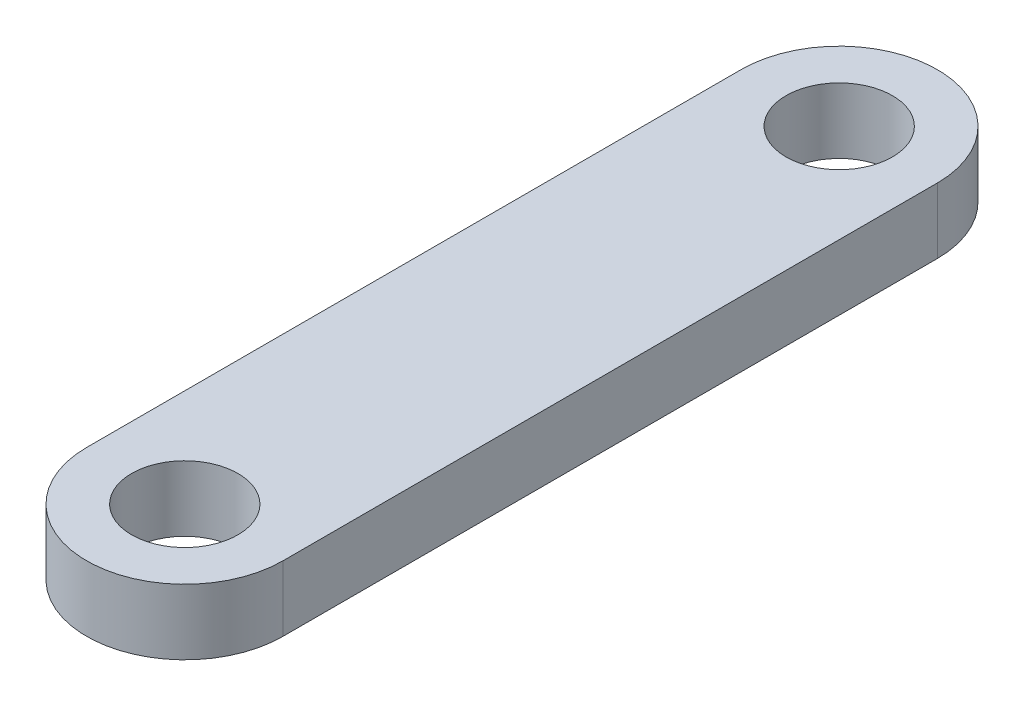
ISO-10303-21;
HEADER;
FILE_DESCRIPTION(('STEP AP214'),'2;1');
FILE_NAME('part.step','',(''),(''),'','','');
FILE_SCHEMA(('AUTOMOTIVE_DESIGN { 1 0 10303 214 1 1 1 1 }'));
ENDSEC;
DATA;
#1=APPLICATION_CONTEXT('core data for automotive mechanical design processes');
#2=APPLICATION_PROTOCOL_DEFINITION('international standard','automotive_design',2000,#1);
#3=PRODUCT_CONTEXT('',#1,'mechanical');
#4=PRODUCT('Part','Part','',(#3));
#5=PRODUCT_RELATED_PRODUCT_CATEGORY('part','',(#4));
#6=PRODUCT_DEFINITION_FORMATION('','',#4);
#7=PRODUCT_DEFINITION_CONTEXT('part definition',#1,'design');
#8=PRODUCT_DEFINITION('design','',#6,#7);
#9=PRODUCT_DEFINITION_SHAPE('','',#8);
#10=(LENGTH_UNIT() NAMED_UNIT(*) SI_UNIT(.MILLI.,.METRE.));
#11=(NAMED_UNIT(*) PLANE_ANGLE_UNIT() SI_UNIT($,.RADIAN.));
#12=(NAMED_UNIT(*) SI_UNIT($,.STERADIAN.) SOLID_ANGLE_UNIT());
#13=UNCERTAINTY_MEASURE_WITH_UNIT(LENGTH_MEASURE(1.E-05),#10,'distance_accuracy_value','');
#14=(GEOMETRIC_REPRESENTATION_CONTEXT(3) GLOBAL_UNCERTAINTY_ASSIGNED_CONTEXT((#13)) GLOBAL_UNIT_ASSIGNED_CONTEXT((#10,
#11,#12)) REPRESENTATION_CONTEXT('',''));
#15=CARTESIAN_POINT('',(0.,0.,0.));
#16=DIRECTION('',(0.,0.,1.));
#17=DIRECTION('',(1.,0.,0.));
#18=AXIS2_PLACEMENT_3D('',#15,#16,#17);
#19=CARTESIAN_POINT('',(0.,4.,-40.));
#20=DIRECTION('',(0.,1.,0.));
#21=DIRECTION('',(0.,0.,1.));
#22=AXIS2_PLACEMENT_3D('',#19,#20,#21);
#23=PLANE('',#22);
#24=CARTESIAN_POINT('',(0.,4.,-40.));
#25=DIRECTION('',(0.,1.,0.));
#26=DIRECTION('',(0.,0.,1.));
#27=AXIS2_PLACEMENT_3D('',#24,#25,#26);
#28=CIRCLE('',#27,3.25);
#29=CARTESIAN_POINT('',(0.,4.,-36.75));
#30=VERTEX_POINT('',#29);
#31=EDGE_CURVE('E98',#30,#30,#28,.T.);
#32=ORIENTED_EDGE('',*,*,#31,.F.);
#33=EDGE_LOOP('',(#32));
#34=FACE_BOUND('',#33,.T.);
#35=CARTESIAN_POINT('',(0.,4.,-40.));
#36=DIRECTION('',(0.,1.,0.));
#37=DIRECTION('',(0.,0.,1.));
#38=AXIS2_PLACEMENT_3D('',#35,#36,#37);
#39=CIRCLE('',#38,6.);
#40=CARTESIAN_POINT('',(6.,4.,-40.));
#41=VERTEX_POINT('',#40);
#42=CARTESIAN_POINT('',(-6.,4.,-40.));
#43=VERTEX_POINT('',#42);
#44=EDGE_CURVE('E83',#41,#43,#39,.T.);
#45=ORIENTED_EDGE('',*,*,#44,.T.);
#46=DIRECTION('',(0.,0.,1.));
#47=VECTOR('',#46,1.);
#48=CARTESIAN_POINT('',(-6.,4.,-40.));
#49=LINE('',#48,#47);
#50=CARTESIAN_POINT('',(-6.,4.,0.));
#51=VERTEX_POINT('',#50);
#52=EDGE_CURVE('E78',#43,#51,#49,.T.);
#53=ORIENTED_EDGE('',*,*,#52,.T.);
#54=CARTESIAN_POINT('',(0.,4.,0.));
#55=DIRECTION('',(0.,1.,0.));
#56=DIRECTION('',(0.,0.,1.));
#57=AXIS2_PLACEMENT_3D('',#54,#55,#56);
#58=CIRCLE('',#57,6.);
#59=CARTESIAN_POINT('',(6.,4.,0.));
#60=VERTEX_POINT('',#59);
#61=EDGE_CURVE('E81',#51,#60,#58,.T.);
#62=ORIENTED_EDGE('',*,*,#61,.T.);
#63=DIRECTION('',(0.,0.,-1.));
#64=VECTOR('',#63,1.);
#65=CARTESIAN_POINT('',(6.,4.,-40.));
#66=LINE('',#65,#64);
#67=EDGE_CURVE('E48',#60,#41,#66,.T.);
#68=ORIENTED_EDGE('',*,*,#67,.T.);
#69=EDGE_LOOP('',(#45,#53,#62,#68));
#70=FACE_BOUND('',#69,.T.);
#71=CARTESIAN_POINT('',(0.,4.,0.));
#72=DIRECTION('',(0.,1.,0.));
#73=DIRECTION('',(0.,0.,1.));
#74=AXIS2_PLACEMENT_3D('',#71,#72,#73);
#75=CIRCLE('',#74,3.25);
#76=CARTESIAN_POINT('',(0.,4.,3.25));
#77=VERTEX_POINT('',#76);
#78=EDGE_CURVE('E113',#77,#77,#75,.T.);
#79=ORIENTED_EDGE('',*,*,#78,.F.);
#80=EDGE_LOOP('',(#79));
#81=FACE_BOUND('',#80,.T.);
#82=ADVANCED_FACE('F31',(#34,#70,#81),#23,.T.);
#83=CARTESIAN_POINT('',(0.,0.,-40.));
#84=DIRECTION('',(0.,1.,0.));
#85=DIRECTION('',(0.,0.,1.));
#86=AXIS2_PLACEMENT_3D('',#83,#84,#85);
#87=PLANE('',#86);
#88=CARTESIAN_POINT('',(0.,0.,-40.));
#89=DIRECTION('',(0.,1.,0.));
#90=DIRECTION('',(0.,0.,1.));
#91=AXIS2_PLACEMENT_3D('',#88,#89,#90);
#92=CIRCLE('',#91,3.25);
#93=CARTESIAN_POINT('',(0.,0.,-36.75));
#94=VERTEX_POINT('',#93);
#95=EDGE_CURVE('E110',#94,#94,#92,.T.);
#96=ORIENTED_EDGE('',*,*,#95,.T.);
#97=EDGE_LOOP('',(#96));
#98=FACE_BOUND('',#97,.T.);
#99=CARTESIAN_POINT('',(0.,0.,-40.));
#100=DIRECTION('',(0.,1.,0.));
#101=DIRECTION('',(0.,0.,1.));
#102=AXIS2_PLACEMENT_3D('',#99,#100,#101);
#103=CIRCLE('',#102,6.);
#104=CARTESIAN_POINT('',(6.,0.,-40.));
#105=VERTEX_POINT('',#104);
#106=CARTESIAN_POINT('',(-6.,0.,-40.));
#107=VERTEX_POINT('',#106);
#108=EDGE_CURVE('E95',#105,#107,#103,.T.);
#109=ORIENTED_EDGE('',*,*,#108,.F.);
#110=DIRECTION('',(0.,0.,-1.));
#111=VECTOR('',#110,1.);
#112=CARTESIAN_POINT('',(6.,0.,-40.));
#113=LINE('',#112,#111);
#114=CARTESIAN_POINT('',(6.,0.,0.));
#115=VERTEX_POINT('',#114);
#116=EDGE_CURVE('E71',#115,#105,#113,.T.);
#117=ORIENTED_EDGE('',*,*,#116,.F.);
#118=CARTESIAN_POINT('',(0.,0.,0.));
#119=DIRECTION('',(0.,1.,0.));
#120=DIRECTION('',(0.,0.,1.));
#121=AXIS2_PLACEMENT_3D('',#118,#119,#120);
#122=CIRCLE('',#121,6.);
#123=CARTESIAN_POINT('',(-6.,0.,0.));
#124=VERTEX_POINT('',#123);
#125=EDGE_CURVE('E65',#124,#115,#122,.T.);
#126=ORIENTED_EDGE('',*,*,#125,.F.);
#127=DIRECTION('',(0.,0.,1.));
#128=VECTOR('',#127,1.);
#129=CARTESIAN_POINT('',(-6.,0.,-40.));
#130=LINE('',#129,#128);
#131=EDGE_CURVE('E87',#107,#124,#130,.T.);
#132=ORIENTED_EDGE('',*,*,#131,.F.);
#133=EDGE_LOOP('',(#109,#117,#126,#132));
#134=FACE_BOUND('',#133,.T.);
#135=CARTESIAN_POINT('',(0.,0.,0.));
#136=DIRECTION('',(0.,1.,0.));
#137=DIRECTION('',(0.,0.,1.));
#138=AXIS2_PLACEMENT_3D('',#135,#136,#137);
#139=CIRCLE('',#138,3.25);
#140=CARTESIAN_POINT('',(0.,0.,3.25));
#141=VERTEX_POINT('',#140);
#142=EDGE_CURVE('E116',#141,#141,#139,.T.);
#143=ORIENTED_EDGE('',*,*,#142,.T.);
#144=EDGE_LOOP('',(#143));
#145=FACE_BOUND('',#144,.T.);
#146=ADVANCED_FACE('F106',(#98,#134,#145),#87,.F.);
#147=CARTESIAN_POINT('',(0.,4.,-40.));
#148=DIRECTION('',(0.,-1.,0.));
#149=DIRECTION('',(0.,0.,-1.));
#150=AXIS2_PLACEMENT_3D('',#147,#148,#149);
#151=CYLINDRICAL_SURFACE('',#150,6.);
#152=ORIENTED_EDGE('',*,*,#108,.T.);
#153=DIRECTION('',(0.,-1.,0.));
#154=VECTOR('',#153,1.);
#155=CARTESIAN_POINT('',(-6.,4.,-40.));
#156=LINE('',#155,#154);
#157=EDGE_CURVE('E11',#43,#107,#156,.T.);
#158=ORIENTED_EDGE('',*,*,#157,.F.);
#159=ORIENTED_EDGE('',*,*,#44,.F.);
#160=DIRECTION('',(0.,-1.,0.));
#161=VECTOR('',#160,1.);
#162=CARTESIAN_POINT('',(6.,4.,-40.));
#163=LINE('',#162,#161);
#164=EDGE_CURVE('E91',#41,#105,#163,.T.);
#165=ORIENTED_EDGE('',*,*,#164,.T.);
#166=EDGE_LOOP('',(#152,#158,#159,#165));
#167=FACE_BOUND('',#166,.T.);
#168=ADVANCED_FACE('F33',(#167),#151,.T.);
#169=CARTESIAN_POINT('',(-6.,4.,-40.));
#170=DIRECTION('',(1.,0.,0.));
#171=DIRECTION('',(0.,0.,-1.));
#172=AXIS2_PLACEMENT_3D('',#169,#170,#171);
#173=PLANE('',#172);
#174=ORIENTED_EDGE('',*,*,#131,.T.);
#175=DIRECTION('',(0.,-1.,0.));
#176=VECTOR('',#175,1.);
#177=CARTESIAN_POINT('',(-6.,4.,0.));
#178=LINE('',#177,#176);
#179=EDGE_CURVE('E40',#51,#124,#178,.T.);
#180=ORIENTED_EDGE('',*,*,#179,.F.);
#181=ORIENTED_EDGE('',*,*,#52,.F.);
#182=ORIENTED_EDGE('',*,*,#157,.T.);
#183=EDGE_LOOP('',(#174,#180,#181,#182));
#184=FACE_BOUND('',#183,.T.);
#185=ADVANCED_FACE('F86',(#184),#173,.F.);
#186=CARTESIAN_POINT('',(0.,4.,0.));
#187=DIRECTION('',(0.,-1.,0.));
#188=DIRECTION('',(0.,0.,-1.));
#189=AXIS2_PLACEMENT_3D('',#186,#187,#188);
#190=CYLINDRICAL_SURFACE('',#189,6.);
#191=ORIENTED_EDGE('',*,*,#125,.T.);
#192=DIRECTION('',(0.,-1.,0.));
#193=VECTOR('',#192,1.);
#194=CARTESIAN_POINT('',(6.,4.,0.));
#195=LINE('',#194,#193);
#196=EDGE_CURVE('E88',#60,#115,#195,.T.);
#197=ORIENTED_EDGE('',*,*,#196,.F.);
#198=ORIENTED_EDGE('',*,*,#61,.F.);
#199=ORIENTED_EDGE('',*,*,#179,.T.);
#200=EDGE_LOOP('',(#191,#197,#198,#199));
#201=FACE_BOUND('',#200,.T.);
#202=ADVANCED_FACE('F89',(#201),#190,.T.);
#203=CARTESIAN_POINT('',(6.,4.,-40.));
#204=DIRECTION('',(-1.,0.,0.));
#205=DIRECTION('',(0.,0.,1.));
#206=AXIS2_PLACEMENT_3D('',#203,#204,#205);
#207=PLANE('',#206);
#208=ORIENTED_EDGE('',*,*,#116,.T.);
#209=ORIENTED_EDGE('',*,*,#164,.F.);
#210=ORIENTED_EDGE('',*,*,#67,.F.);
#211=ORIENTED_EDGE('',*,*,#196,.T.);
#212=EDGE_LOOP('',(#208,#209,#210,#211));
#213=FACE_BOUND('',#212,.T.);
#214=ADVANCED_FACE('F103',(#213),#207,.F.);
#215=CARTESIAN_POINT('',(0.,4.,-40.));
#216=DIRECTION('',(0.,-1.,0.));
#217=DIRECTION('',(0.,0.,-1.));
#218=AXIS2_PLACEMENT_3D('',#215,#216,#217);
#219=CYLINDRICAL_SURFACE('',#218,3.25);
#220=ORIENTED_EDGE('',*,*,#31,.T.);
#221=EDGE_LOOP('',(#220));
#222=FACE_BOUND('',#221,.T.);
#223=ORIENTED_EDGE('',*,*,#95,.F.);
#224=EDGE_LOOP('',(#223));
#225=FACE_BOUND('',#224,.T.);
#226=ADVANCED_FACE('F134',(#222,#225),#219,.F.);
#227=CARTESIAN_POINT('',(0.,4.,0.));
#228=DIRECTION('',(0.,-1.,0.));
#229=DIRECTION('',(0.,0.,-1.));
#230=AXIS2_PLACEMENT_3D('',#227,#228,#229);
#231=CYLINDRICAL_SURFACE('',#230,3.25);
#232=ORIENTED_EDGE('',*,*,#78,.T.);
#233=EDGE_LOOP('',(#232));
#234=FACE_BOUND('',#233,.T.);
#235=ORIENTED_EDGE('',*,*,#142,.F.);
#236=EDGE_LOOP('',(#235));
#237=FACE_BOUND('',#236,.T.);
#238=ADVANCED_FACE('F122',(#234,#237),#231,.F.);
#239=CLOSED_SHELL('',(#82,#146,#168,#185,#202,#214,#226,#238));
#240=MANIFOLD_SOLID_BREP('B2',#239);
#241=ADVANCED_BREP_SHAPE_REPRESENTATION('',(#18,#240),#14);
#242=SHAPE_DEFINITION_REPRESENTATION(#9,#241);
ENDSEC;
END-ISO-10303-21;
